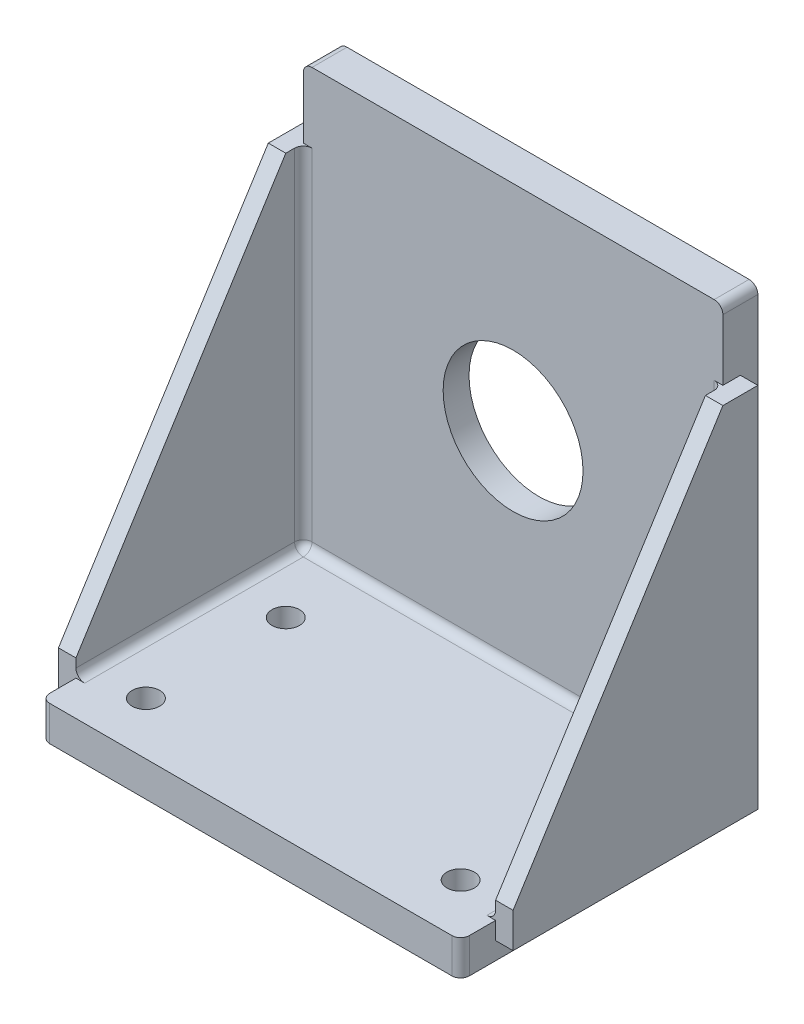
from build123d import *

# Parameters (mm, degrees)
SKETCH1_W            = 152.4
SKETCH1_H            = 152.4
BASE_EXTRUDE_DEPTH   = 12.7
SKETCH2_W            = 101.6
SKETCH2_H            = 12.7
BOSS_EXTRUDE1_DEPTH  = 152.4
BOSS_EXTRUDE2_DEPTH  = 6.35
PER_AGE1_D           = 10
LPATTERN1_COUNT      = 2
LPATTERN1_PITCH      = 114.3
LPATTERN1_COUNT_DIR2 = 2
LPATTERN1_PITCH_DIR2 = 50.8
SKETCH5_R            = 63.5635
PILOT_BORE_DEPTH     = 3.302
SKETCH6_R            = 25.4
CUT_EXTRUDE3_DEPTH   = 160.339822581
FILLET1_R            = 3.175
FILLET2_R            = 3.175


with BuildPart() as part:
    # Sketch1 → Base-Extrude (new body)
    with BuildSketch(Plane.XY):
        with Locations((0, 1.5875)):
            Rectangle(SKETCH1_W, SKETCH1_H)
    extrude(amount=BASE_EXTRUDE_DEPTH)

    # Sketch2 → Boss-Extrude1 (add)
    with BuildSketch(Plane(origin=(76.2, 0, 0), x_dir=(0, 0, -1), z_dir=(1, 0, 0))):
        with Locations((-57.15, -80.9625)):
            Rectangle(SKETCH2_W, SKETCH2_H)
    extrude(amount=-BOSS_EXTRUDE1_DEPTH)

    # Sketch3 → Boss-Extrude2 (add)
    with BuildSketch(Plane(origin=(76.2, 0, 0), x_dir=(0, 0, -1), z_dir=(1, 0, 0))):
        Polygon((-6.35, -80.9625), (-6.35, 52.3875), (-19.05, 52.3875), (-95.25, -68.2625), (-95.25, -80.9625), align=None)
    boss_extrude2 = extrude(amount=BOSS_EXTRUDE2_DEPTH)

    # Mirror1: Boss-Extrude2 across plane
    add(boss_extrude2.mirror(Plane(origin=(0, 0, 0), x_dir=(0, 0, 1), z_dir=(1, 0, 0))))

    # Per_age1 (through all)
    with Locations(Plane(origin=(0, -74.6125, 0), x_dir=(1, 0, 0), z_dir=(0, 1, 0))):
        with Locations((-57.15, -88.9)):
            per_age1 = Hole(PER_AGE1_D / 2)

    # LPattern1: Per_age1 2 × 2
    with Locations(*[(i * LPATTERN1_PITCH, 0, -j * LPATTERN1_PITCH_DIR2) for i in range(LPATTERN1_COUNT) for j in range(LPATTERN1_COUNT_DIR2) if (i, j) != (0, 0)]):
        add(per_age1, mode=Mode.SUBTRACT)

    # Sketch5 → pilot bore (cut)
    with BuildSketch(Plane(origin=(0, 0, 0), x_dir=(-1, 0, 0), z_dir=(0, 0, -1))):
        Circle(SKETCH5_R)
    extrude(amount=-PILOT_BORE_DEPTH, mode=Mode.SUBTRACT)

    # Sketch6 → Cut-Extrude3 (cut, through all)
    with BuildSketch(Plane(origin=(0, 0, 3.302), x_dir=(-1, 0, 0), z_dir=(0, 0, -1))):
        Circle(SKETCH6_R)
    extrude(amount=-CUT_EXTRUDE3_DEPTH, mode=Mode.SUBTRACT)

    # Fillet1
    fillet1_edges = [part.edges().sort_by_distance(p)[0] for p in [
        (0, -74.6125, 12.7),
    ]]
    fillet(fillet1_edges, radius=FILLET1_R)

    # Fillet2
    fillet2_edges = [part.edges().sort_by_distance(p)[0] for p in [
        (76.2, -9.525, 12.7),
        (-76.2, -9.525, 12.7),
        (76.2, -73.68256403, 13.62993597),
        (76.2, -74.6125, 55.5625),
        (-76.2, -73.68256403, 13.62993597),
        (76.2, 77.7875, 6.35),
        (-76.2, -74.6125, 55.5625),
        (-76.2, 77.7875, 6.35),
        (76.2, -80.9625, 107.95),
        (-76.2, -80.9625, 107.95),
    ]]
    fillet(fillet2_edges, radius=FILLET2_R)


solid = part.part
